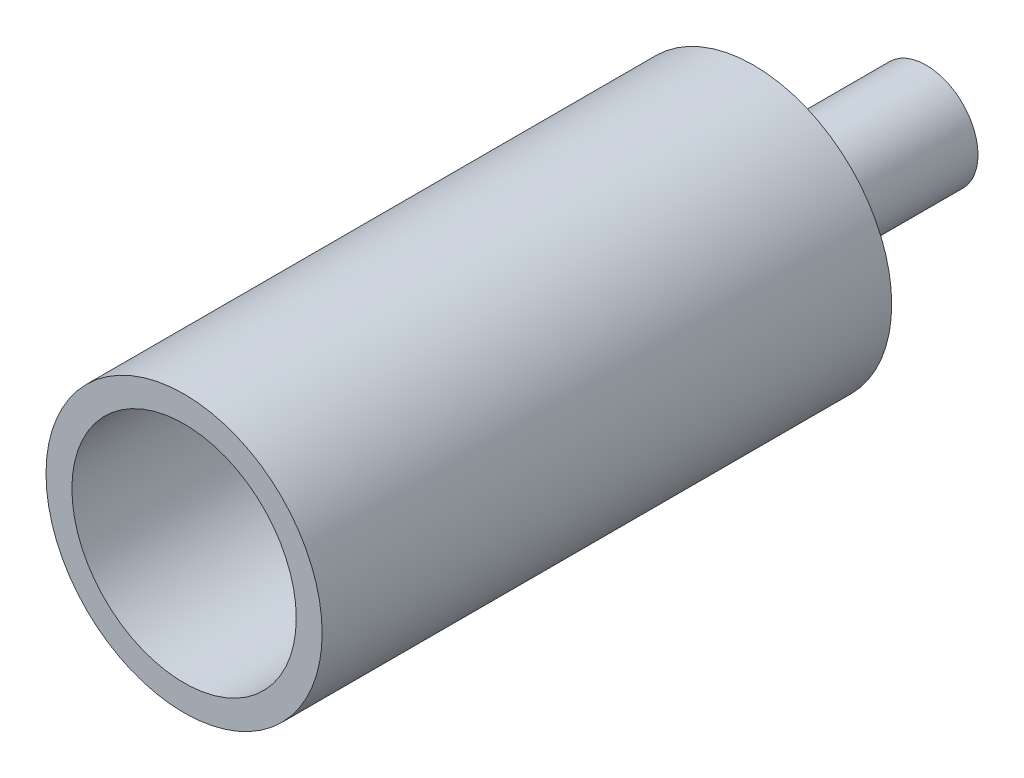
ISO-10303-21;
HEADER;
FILE_DESCRIPTION(('STEP AP214'),'2;1');
FILE_NAME('part.step','',(''),(''),'','','');
FILE_SCHEMA(('AUTOMOTIVE_DESIGN { 1 0 10303 214 1 1 1 1 }'));
ENDSEC;
DATA;
#1=APPLICATION_CONTEXT('core data for automotive mechanical design processes');
#2=APPLICATION_PROTOCOL_DEFINITION('international standard','automotive_design',2000,#1);
#3=PRODUCT_CONTEXT('',#1,'mechanical');
#4=PRODUCT('Part','Part','',(#3));
#5=PRODUCT_RELATED_PRODUCT_CATEGORY('part','',(#4));
#6=PRODUCT_DEFINITION_FORMATION('','',#4);
#7=PRODUCT_DEFINITION_CONTEXT('part definition',#1,'design');
#8=PRODUCT_DEFINITION('design','',#6,#7);
#9=PRODUCT_DEFINITION_SHAPE('','',#8);
#10=(LENGTH_UNIT() NAMED_UNIT(*) SI_UNIT(.MILLI.,.METRE.));
#11=(NAMED_UNIT(*) PLANE_ANGLE_UNIT() SI_UNIT($,.RADIAN.));
#12=(NAMED_UNIT(*) SI_UNIT($,.STERADIAN.) SOLID_ANGLE_UNIT());
#13=UNCERTAINTY_MEASURE_WITH_UNIT(LENGTH_MEASURE(1.E-05),#10,'distance_accuracy_value','');
#14=(GEOMETRIC_REPRESENTATION_CONTEXT(3) GLOBAL_UNCERTAINTY_ASSIGNED_CONTEXT((#13)) GLOBAL_UNIT_ASSIGNED_CONTEXT((#10,
#11,#12)) REPRESENTATION_CONTEXT('',''));
#15=CARTESIAN_POINT('',(0.,0.,0.));
#16=DIRECTION('',(0.,0.,1.));
#17=DIRECTION('',(1.,0.,0.));
#18=AXIS2_PLACEMENT_3D('',#15,#16,#17);
#19=CARTESIAN_POINT('',(-13.,3.92823712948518,-5.));
#20=DIRECTION('',(0.,0.,1.));
#21=DIRECTION('',(1.,0.,0.));
#22=AXIS2_PLACEMENT_3D('',#19,#20,#21);
#23=CYLINDRICAL_SURFACE('',#22,1.5);
#24=CARTESIAN_POINT('',(-13.,3.92823712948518,-5.));
#25=DIRECTION('',(0.,0.,1.));
#26=DIRECTION('',(1.,0.,0.));
#27=AXIS2_PLACEMENT_3D('',#24,#25,#26);
#28=CIRCLE('',#27,1.5);
#29=CARTESIAN_POINT('',(-11.5,3.92823712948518,-5.));
#30=VERTEX_POINT('',#29);
#31=EDGE_CURVE('E39',#30,#30,#28,.T.);
#32=ORIENTED_EDGE('',*,*,#31,.T.);
#33=EDGE_LOOP('',(#32));
#34=FACE_BOUND('',#33,.T.);
#35=CARTESIAN_POINT('',(-13.,3.92823712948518,0.));
#36=DIRECTION('',(0.,0.,1.));
#37=DIRECTION('',(1.,0.,0.));
#38=AXIS2_PLACEMENT_3D('',#35,#36,#37);
#39=CIRCLE('',#38,1.5);
#40=CARTESIAN_POINT('',(-11.5,3.92823712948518,0.));
#41=VERTEX_POINT('',#40);
#42=EDGE_CURVE('E43',#41,#41,#39,.T.);
#43=ORIENTED_EDGE('',*,*,#42,.F.);
#44=EDGE_LOOP('',(#43));
#45=FACE_BOUND('',#44,.T.);
#46=ADVANCED_FACE('F33',(#34,#45),#23,.T.);
#47=CARTESIAN_POINT('',(-13.,3.92823712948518,-5.));
#48=DIRECTION('',(0.,0.,1.));
#49=DIRECTION('',(1.,0.,0.));
#50=AXIS2_PLACEMENT_3D('',#47,#48,#49);
#51=PLANE('',#50);
#52=CARTESIAN_POINT('',(-13.,3.92823712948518,-5.));
#53=DIRECTION('',(0.,0.,1.));
#54=DIRECTION('',(1.,0.,0.));
#55=AXIS2_PLACEMENT_3D('',#52,#53,#54);
#56=CIRCLE('',#55,0.749999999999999);
#57=CARTESIAN_POINT('',(-12.25,3.92823712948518,-5.));
#58=VERTEX_POINT('',#57);
#59=EDGE_CURVE('E47',#58,#58,#56,.T.);
#60=ORIENTED_EDGE('',*,*,#59,.T.);
#61=EDGE_LOOP('',(#60));
#62=FACE_BOUND('',#61,.T.);
#63=ORIENTED_EDGE('',*,*,#31,.F.);
#64=EDGE_LOOP('',(#63));
#65=FACE_BOUND('',#64,.T.);
#66=ADVANCED_FACE('F82',(#62,#65),#51,.F.);
#67=CARTESIAN_POINT('',(-13.,3.92823712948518,-5.));
#68=DIRECTION('',(0.,0.,1.));
#69=DIRECTION('',(1.,0.,0.));
#70=AXIS2_PLACEMENT_3D('',#67,#68,#69);
#71=CYLINDRICAL_SURFACE('',#70,0.749999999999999);
#72=ORIENTED_EDGE('',*,*,#59,.F.);
#73=EDGE_LOOP('',(#72));
#74=FACE_BOUND('',#73,.T.);
#75=CARTESIAN_POINT('',(-13.,3.92823712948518,1.));
#76=DIRECTION('',(0.,0.,1.));
#77=DIRECTION('',(1.,0.,0.));
#78=AXIS2_PLACEMENT_3D('',#75,#76,#77);
#79=CIRCLE('',#78,0.749999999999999);
#80=CARTESIAN_POINT('',(-12.25,3.92823712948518,1.));
#81=VERTEX_POINT('',#80);
#82=EDGE_CURVE('E55',#81,#81,#79,.T.);
#83=ORIENTED_EDGE('',*,*,#82,.T.);
#84=EDGE_LOOP('',(#83));
#85=FACE_BOUND('',#84,.T.);
#86=ADVANCED_FACE('F86',(#74,#85),#71,.F.);
#87=CARTESIAN_POINT('',(-13.,3.92823712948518,1.));
#88=DIRECTION('',(0.,0.,1.));
#89=DIRECTION('',(1.,0.,0.));
#90=AXIS2_PLACEMENT_3D('',#87,#88,#89);
#91=PLANE('',#90);
#92=CARTESIAN_POINT('',(-13.,3.92823712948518,1.));
#93=DIRECTION('',(0.,0.,1.));
#94=DIRECTION('',(1.,0.,0.));
#95=AXIS2_PLACEMENT_3D('',#92,#93,#94);
#96=CIRCLE('',#95,3.25);
#97=CARTESIAN_POINT('',(-9.75,3.92823712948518,1.));
#98=VERTEX_POINT('',#97);
#99=EDGE_CURVE('E10',#98,#98,#96,.F.);
#100=ORIENTED_EDGE('',*,*,#99,.F.);
#101=EDGE_LOOP('',(#100));
#102=FACE_BOUND('',#101,.T.);
#103=ORIENTED_EDGE('',*,*,#82,.F.);
#104=EDGE_LOOP('',(#103));
#105=FACE_BOUND('',#104,.T.);
#106=ADVANCED_FACE('F93',(#102,#105),#91,.T.);
#107=CARTESIAN_POINT('',(-13.,3.92823712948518,0.));
#108=DIRECTION('',(0.,0.,1.));
#109=DIRECTION('',(1.,0.,0.));
#110=AXIS2_PLACEMENT_3D('',#107,#108,#109);
#111=PLANE('',#110);
#112=ORIENTED_EDGE('',*,*,#42,.T.);
#113=EDGE_LOOP('',(#112));
#114=FACE_BOUND('',#113,.T.);
#115=CARTESIAN_POINT('',(-13.,3.92823712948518,0.));
#116=DIRECTION('',(0.,0.,1.));
#117=DIRECTION('',(1.,0.,0.));
#118=AXIS2_PLACEMENT_3D('',#115,#116,#117);
#119=CIRCLE('',#118,4.);
#120=CARTESIAN_POINT('',(-9.,3.92823712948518,0.));
#121=VERTEX_POINT('',#120);
#122=EDGE_CURVE('E52',#121,#121,#119,.T.);
#123=ORIENTED_EDGE('',*,*,#122,.F.);
#124=EDGE_LOOP('',(#123));
#125=FACE_BOUND('',#124,.T.);
#126=ADVANCED_FACE('F77',(#114,#125),#111,.F.);
#127=CARTESIAN_POINT('',(-13.,3.92823712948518,1.));
#128=DIRECTION('',(0.,0.,-1.));
#129=DIRECTION('',(-1.,0.,0.));
#130=AXIS2_PLACEMENT_3D('',#127,#128,#129);
#131=CYLINDRICAL_SURFACE('',#130,4.);
#132=ORIENTED_EDGE('',*,*,#122,.T.);
#133=EDGE_LOOP('',(#132));
#134=FACE_BOUND('',#133,.T.);
#135=CARTESIAN_POINT('',(-13.,3.92823712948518,16.5));
#136=DIRECTION('',(0.,0.,1.));
#137=DIRECTION('',(1.,0.,0.));
#138=AXIS2_PLACEMENT_3D('',#135,#136,#137);
#139=CIRCLE('',#138,4.);
#140=CARTESIAN_POINT('',(-9.,3.92823712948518,16.5));
#141=VERTEX_POINT('',#140);
#142=EDGE_CURVE('E58',#141,#141,#139,.T.);
#143=ORIENTED_EDGE('',*,*,#142,.F.);
#144=EDGE_LOOP('',(#143));
#145=FACE_BOUND('',#144,.T.);
#146=ADVANCED_FACE('F69',(#134,#145),#131,.T.);
#147=CARTESIAN_POINT('',(-13.,3.92823712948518,16.5));
#148=DIRECTION('',(0.,0.,1.));
#149=DIRECTION('',(1.,0.,0.));
#150=AXIS2_PLACEMENT_3D('',#147,#148,#149);
#151=PLANE('',#150);
#152=ORIENTED_EDGE('',*,*,#142,.T.);
#153=EDGE_LOOP('',(#152));
#154=FACE_BOUND('',#153,.T.);
#155=CARTESIAN_POINT('',(-13.,3.92823712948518,16.5));
#156=DIRECTION('',(0.,0.,1.));
#157=DIRECTION('',(1.,0.,0.));
#158=AXIS2_PLACEMENT_3D('',#155,#156,#157);
#159=CIRCLE('',#158,3.25);
#160=CARTESIAN_POINT('',(-9.75,3.92823712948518,16.5));
#161=VERTEX_POINT('',#160);
#162=EDGE_CURVE('E61',#161,#161,#159,.T.);
#163=ORIENTED_EDGE('',*,*,#162,.F.);
#164=EDGE_LOOP('',(#163));
#165=FACE_BOUND('',#164,.T.);
#166=ADVANCED_FACE('F67',(#154,#165),#151,.T.);
#167=CARTESIAN_POINT('',(-13.,3.92823712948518,16.5));
#168=DIRECTION('',(0.,0.,-1.));
#169=DIRECTION('',(-1.,0.,0.));
#170=AXIS2_PLACEMENT_3D('',#167,#168,#169);
#171=CYLINDRICAL_SURFACE('',#170,3.25);
#172=ORIENTED_EDGE('',*,*,#162,.T.);
#173=EDGE_LOOP('',(#172));
#174=FACE_BOUND('',#173,.T.);
#175=ORIENTED_EDGE('',*,*,#99,.T.);
#176=EDGE_LOOP('',(#175));
#177=FACE_BOUND('',#176,.T.);
#178=ADVANCED_FACE('F65',(#174,#177),#171,.F.);
#179=CLOSED_SHELL('',(#46,#66,#86,#106,#126,#146,#166,#178));
#180=MANIFOLD_SOLID_BREP('B2',#179);
#181=ADVANCED_BREP_SHAPE_REPRESENTATION('',(#18,#180),#14);
#182=SHAPE_DEFINITION_REPRESENTATION(#9,#181);
ENDSEC;
END-ISO-10303-21;
